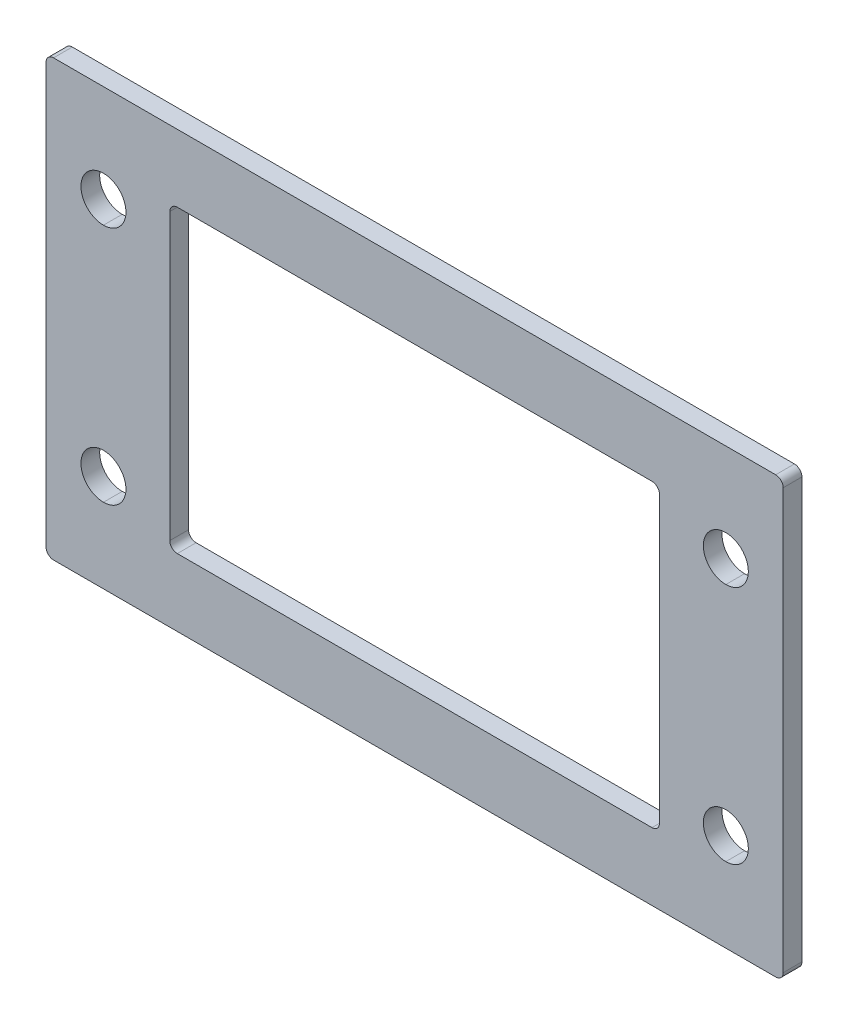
ISO-10303-21;
HEADER;
FILE_DESCRIPTION(('STEP AP214'),'2;1');
FILE_NAME('part.step','',(''),(''),'','','');
FILE_SCHEMA(('AUTOMOTIVE_DESIGN { 1 0 10303 214 1 1 1 1 }'));
ENDSEC;
DATA;
#1=APPLICATION_CONTEXT('core data for automotive mechanical design processes');
#2=APPLICATION_PROTOCOL_DEFINITION('international standard','automotive_design',2000,#1);
#3=PRODUCT_CONTEXT('',#1,'mechanical');
#4=PRODUCT('Part','Part','',(#3));
#5=PRODUCT_RELATED_PRODUCT_CATEGORY('part','',(#4));
#6=PRODUCT_DEFINITION_FORMATION('','',#4);
#7=PRODUCT_DEFINITION_CONTEXT('part definition',#1,'design');
#8=PRODUCT_DEFINITION('design','',#6,#7);
#9=PRODUCT_DEFINITION_SHAPE('','',#8);
#10=(LENGTH_UNIT() NAMED_UNIT(*) SI_UNIT(.MILLI.,.METRE.));
#11=(NAMED_UNIT(*) PLANE_ANGLE_UNIT() SI_UNIT($,.RADIAN.));
#12=(NAMED_UNIT(*) SI_UNIT($,.STERADIAN.) SOLID_ANGLE_UNIT());
#13=UNCERTAINTY_MEASURE_WITH_UNIT(LENGTH_MEASURE(1.E-05),#10,'distance_accuracy_value','');
#14=(GEOMETRIC_REPRESENTATION_CONTEXT(3) GLOBAL_UNCERTAINTY_ASSIGNED_CONTEXT((#13)) GLOBAL_UNIT_ASSIGNED_CONTEXT((#10,
#11,#12)) REPRESENTATION_CONTEXT('',''));
#15=CARTESIAN_POINT('',(0.,0.,0.));
#16=DIRECTION('',(0.,0.,1.));
#17=DIRECTION('',(1.,0.,0.));
#18=AXIS2_PLACEMENT_3D('',#15,#16,#17);
#19=CARTESIAN_POINT('',(-48.15,28.,-8.525));
#20=DIRECTION('',(0.,0.,-1.));
#21=DIRECTION('',(0.,1.,0.));
#22=AXIS2_PLACEMENT_3D('',#19,#20,#21);
#23=CYLINDRICAL_SURFACE('',#22,1.);
#24=CARTESIAN_POINT('',(-48.15,28.,-8.525));
#25=DIRECTION('',(0.,0.,1.));
#26=DIRECTION('',(0.,-1.,0.));
#27=AXIS2_PLACEMENT_3D('',#24,#25,#26);
#28=CIRCLE('',#27,1.);
#29=CARTESIAN_POINT('',(-48.15,29.,-8.525));
#30=VERTEX_POINT('',#29);
#31=CARTESIAN_POINT('',(-49.15,28.,-8.525));
#32=VERTEX_POINT('',#31);
#33=EDGE_CURVE('E374',#30,#32,#28,.T.);
#34=ORIENTED_EDGE('',*,*,#33,.F.);
#35=DIRECTION('',(0.,0.,1.));
#36=VECTOR('',#35,1.);
#37=CARTESIAN_POINT('',(-48.15,29.,-8.525));
#38=LINE('',#37,#36);
#39=CARTESIAN_POINT('',(-48.15,29.,-11.025));
#40=VERTEX_POINT('',#39);
#41=EDGE_CURVE('E402',#40,#30,#38,.T.);
#42=ORIENTED_EDGE('',*,*,#41,.F.);
#43=CARTESIAN_POINT('',(-48.15,28.,-11.025));
#44=DIRECTION('',(0.,0.,-1.));
#45=DIRECTION('',(0.,-1.,0.));
#46=AXIS2_PLACEMENT_3D('',#43,#44,#45);
#47=CIRCLE('',#46,1.);
#48=CARTESIAN_POINT('',(-49.15,28.,-11.025));
#49=VERTEX_POINT('',#48);
#50=EDGE_CURVE('E318',#49,#40,#47,.T.);
#51=ORIENTED_EDGE('',*,*,#50,.F.);
#52=DIRECTION('',(0.,0.,-1.));
#53=VECTOR('',#52,1.);
#54=CARTESIAN_POINT('',(-49.15,28.,-8.525));
#55=LINE('',#54,#53);
#56=EDGE_CURVE('E378',#32,#49,#55,.T.);
#57=ORIENTED_EDGE('',*,*,#56,.F.);
#58=EDGE_LOOP('',(#34,#42,#51,#57));
#59=FACE_BOUND('',#58,.T.);
#60=ADVANCED_FACE('F15',(#59),#23,.T.);
#61=CARTESIAN_POINT('',(-48.15,-28.,-8.525));
#62=DIRECTION('',(0.,0.,-1.));
#63=DIRECTION('',(0.,1.,0.));
#64=AXIS2_PLACEMENT_3D('',#61,#62,#63);
#65=CYLINDRICAL_SURFACE('',#64,1.);
#66=CARTESIAN_POINT('',(-48.15,-28.,-8.525));
#67=DIRECTION('',(0.,0.,1.));
#68=DIRECTION('',(0.,-1.,0.));
#69=AXIS2_PLACEMENT_3D('',#66,#67,#68);
#70=CIRCLE('',#69,1.);
#71=CARTESIAN_POINT('',(-49.15,-28.,-8.525));
#72=VERTEX_POINT('',#71);
#73=CARTESIAN_POINT('',(-48.15,-29.,-8.525));
#74=VERTEX_POINT('',#73);
#75=EDGE_CURVE('E386',#72,#74,#70,.T.);
#76=ORIENTED_EDGE('',*,*,#75,.F.);
#77=DIRECTION('',(0.,0.,1.));
#78=VECTOR('',#77,1.);
#79=CARTESIAN_POINT('',(-49.15,-28.,-8.525));
#80=LINE('',#79,#78);
#81=CARTESIAN_POINT('',(-49.15,-28.,-11.025));
#82=VERTEX_POINT('',#81);
#83=EDGE_CURVE('E375',#82,#72,#80,.T.);
#84=ORIENTED_EDGE('',*,*,#83,.F.);
#85=CARTESIAN_POINT('',(-48.15,-28.,-11.025));
#86=DIRECTION('',(0.,0.,-1.));
#87=DIRECTION('',(0.,-1.,0.));
#88=AXIS2_PLACEMENT_3D('',#85,#86,#87);
#89=CIRCLE('',#88,1.);
#90=CARTESIAN_POINT('',(-48.15,-29.,-11.025));
#91=VERTEX_POINT('',#90);
#92=EDGE_CURVE('E330',#91,#82,#89,.T.);
#93=ORIENTED_EDGE('',*,*,#92,.F.);
#94=DIRECTION('',(0.,0.,-1.));
#95=VECTOR('',#94,1.);
#96=CARTESIAN_POINT('',(-48.15,-29.,-8.525));
#97=LINE('',#96,#95);
#98=EDGE_CURVE('E269',#74,#91,#97,.T.);
#99=ORIENTED_EDGE('',*,*,#98,.F.);
#100=EDGE_LOOP('',(#76,#84,#93,#99));
#101=FACE_BOUND('',#100,.T.);
#102=ADVANCED_FACE('F541',(#101),#65,.T.);
#103=CARTESIAN_POINT('',(48.15,28.,-8.525));
#104=DIRECTION('',(0.,0.,-1.));
#105=DIRECTION('',(0.,1.,0.));
#106=AXIS2_PLACEMENT_3D('',#103,#104,#105);
#107=CYLINDRICAL_SURFACE('',#106,1.);
#108=CARTESIAN_POINT('',(48.15,28.,-8.525));
#109=DIRECTION('',(0.,0.,1.));
#110=DIRECTION('',(0.,-1.,0.));
#111=AXIS2_PLACEMENT_3D('',#108,#109,#110);
#112=CIRCLE('',#111,1.);
#113=CARTESIAN_POINT('',(49.15,28.,-8.525));
#114=VERTEX_POINT('',#113);
#115=CARTESIAN_POINT('',(48.15,29.,-8.525));
#116=VERTEX_POINT('',#115);
#117=EDGE_CURVE('E366',#114,#116,#112,.T.);
#118=ORIENTED_EDGE('',*,*,#117,.F.);
#119=DIRECTION('',(0.,0.,1.));
#120=VECTOR('',#119,1.);
#121=CARTESIAN_POINT('',(49.15,28.,-8.525));
#122=LINE('',#121,#120);
#123=CARTESIAN_POINT('',(49.15,28.,-11.025));
#124=VERTEX_POINT('',#123);
#125=EDGE_CURVE('E268',#124,#114,#122,.T.);
#126=ORIENTED_EDGE('',*,*,#125,.F.);
#127=CARTESIAN_POINT('',(48.15,28.,-11.025));
#128=DIRECTION('',(0.,0.,-1.));
#129=DIRECTION('',(0.,-1.,0.));
#130=AXIS2_PLACEMENT_3D('',#127,#128,#129);
#131=CIRCLE('',#130,1.);
#132=CARTESIAN_POINT('',(48.15,29.,-11.025));
#133=VERTEX_POINT('',#132);
#134=EDGE_CURVE('E239',#133,#124,#131,.T.);
#135=ORIENTED_EDGE('',*,*,#134,.F.);
#136=DIRECTION('',(0.,0.,-1.));
#137=VECTOR('',#136,1.);
#138=CARTESIAN_POINT('',(48.15,29.,-8.525));
#139=LINE('',#138,#137);
#140=EDGE_CURVE('E399',#116,#133,#139,.T.);
#141=ORIENTED_EDGE('',*,*,#140,.F.);
#142=EDGE_LOOP('',(#118,#126,#135,#141));
#143=FACE_BOUND('',#142,.T.);
#144=ADVANCED_FACE('F546',(#143),#107,.T.);
#145=CARTESIAN_POINT('',(48.15,-28.,-8.525));
#146=DIRECTION('',(0.,0.,-1.));
#147=DIRECTION('',(0.,1.,0.));
#148=AXIS2_PLACEMENT_3D('',#145,#146,#147);
#149=CYLINDRICAL_SURFACE('',#148,1.);
#150=CARTESIAN_POINT('',(48.15,-28.,-8.525));
#151=DIRECTION('',(0.,0.,1.));
#152=DIRECTION('',(0.,-1.,0.));
#153=AXIS2_PLACEMENT_3D('',#150,#151,#152);
#154=CIRCLE('',#153,1.);
#155=CARTESIAN_POINT('',(48.15,-29.,-8.525));
#156=VERTEX_POINT('',#155);
#157=CARTESIAN_POINT('',(49.15,-28.,-8.525));
#158=VERTEX_POINT('',#157);
#159=EDGE_CURVE('E355',#156,#158,#154,.T.);
#160=ORIENTED_EDGE('',*,*,#159,.F.);
#161=DIRECTION('',(0.,0.,1.));
#162=VECTOR('',#161,1.);
#163=CARTESIAN_POINT('',(48.15,-29.,-8.525));
#164=LINE('',#163,#162);
#165=CARTESIAN_POINT('',(48.15,-29.,-11.025));
#166=VERTEX_POINT('',#165);
#167=EDGE_CURVE('E416',#166,#156,#164,.T.);
#168=ORIENTED_EDGE('',*,*,#167,.F.);
#169=CARTESIAN_POINT('',(48.15,-28.,-11.025));
#170=DIRECTION('',(0.,0.,-1.));
#171=DIRECTION('',(0.,-1.,0.));
#172=AXIS2_PLACEMENT_3D('',#169,#170,#171);
#173=CIRCLE('',#172,1.);
#174=CARTESIAN_POINT('',(49.15,-28.,-11.025));
#175=VERTEX_POINT('',#174);
#176=EDGE_CURVE('E309',#175,#166,#173,.T.);
#177=ORIENTED_EDGE('',*,*,#176,.F.);
#178=DIRECTION('',(0.,0.,-1.));
#179=VECTOR('',#178,1.);
#180=CARTESIAN_POINT('',(49.15,-28.,-8.525));
#181=LINE('',#180,#179);
#182=EDGE_CURVE('E265',#158,#175,#181,.T.);
#183=ORIENTED_EDGE('',*,*,#182,.F.);
#184=EDGE_LOOP('',(#160,#168,#177,#183));
#185=FACE_BOUND('',#184,.T.);
#186=ADVANCED_FACE('F569',(#185),#149,.T.);
#187=CARTESIAN_POINT('',(-31.65,19.,-8.525));
#188=DIRECTION('',(0.,0.,1.));
#189=DIRECTION('',(0.,-1.,0.));
#190=AXIS2_PLACEMENT_3D('',#187,#188,#189);
#191=CYLINDRICAL_SURFACE('',#190,1.);
#192=CARTESIAN_POINT('',(-31.65,19.,-8.525));
#193=DIRECTION('',(0.,0.,-1.));
#194=DIRECTION('',(0.,-1.,0.));
#195=AXIS2_PLACEMENT_3D('',#192,#193,#194);
#196=CIRCLE('',#195,1.);
#197=CARTESIAN_POINT('',(-32.65,19.,-8.525));
#198=VERTEX_POINT('',#197);
#199=CARTESIAN_POINT('',(-31.65,20.,-8.525));
#200=VERTEX_POINT('',#199);
#201=EDGE_CURVE('E420',#198,#200,#196,.T.);
#202=ORIENTED_EDGE('',*,*,#201,.F.);
#203=DIRECTION('',(0.,0.,1.));
#204=VECTOR('',#203,1.);
#205=CARTESIAN_POINT('',(-32.65,19.,-8.525));
#206=LINE('',#205,#204);
#207=CARTESIAN_POINT('',(-32.65,19.,-11.025));
#208=VERTEX_POINT('',#207);
#209=EDGE_CURVE('E484',#208,#198,#206,.T.);
#210=ORIENTED_EDGE('',*,*,#209,.F.);
#211=CARTESIAN_POINT('',(-31.65,19.,-11.025));
#212=DIRECTION('',(0.,0.,1.));
#213=DIRECTION('',(0.,-1.,0.));
#214=AXIS2_PLACEMENT_3D('',#211,#212,#213);
#215=CIRCLE('',#214,1.);
#216=CARTESIAN_POINT('',(-31.65,20.,-11.025));
#217=VERTEX_POINT('',#216);
#218=EDGE_CURVE('E290',#217,#208,#215,.T.);
#219=ORIENTED_EDGE('',*,*,#218,.F.);
#220=DIRECTION('',(0.,0.,-1.));
#221=VECTOR('',#220,1.);
#222=CARTESIAN_POINT('',(-31.65,20.,-11.025));
#223=LINE('',#222,#221);
#224=EDGE_CURVE('E10',#200,#217,#223,.T.);
#225=ORIENTED_EDGE('',*,*,#224,.F.);
#226=EDGE_LOOP('',(#202,#210,#219,#225));
#227=FACE_BOUND('',#226,.T.);
#228=ADVANCED_FACE('F510',(#227),#191,.F.);
#229=CARTESIAN_POINT('',(-31.65,-19.,-8.525));
#230=DIRECTION('',(0.,0.,1.));
#231=DIRECTION('',(0.,-1.,0.));
#232=AXIS2_PLACEMENT_3D('',#229,#230,#231);
#233=CYLINDRICAL_SURFACE('',#232,1.);
#234=CARTESIAN_POINT('',(-31.65,-19.,-8.525));
#235=DIRECTION('',(0.,0.,-1.));
#236=DIRECTION('',(0.,-1.,0.));
#237=AXIS2_PLACEMENT_3D('',#234,#235,#236);
#238=CIRCLE('',#237,1.);
#239=CARTESIAN_POINT('',(-31.65,-20.,-8.525));
#240=VERTEX_POINT('',#239);
#241=CARTESIAN_POINT('',(-32.65,-19.,-8.525));
#242=VERTEX_POINT('',#241);
#243=EDGE_CURVE('E409',#240,#242,#238,.T.);
#244=ORIENTED_EDGE('',*,*,#243,.F.);
#245=DIRECTION('',(0.,0.,1.));
#246=VECTOR('',#245,1.);
#247=CARTESIAN_POINT('',(-31.65,-20.,-8.525));
#248=LINE('',#247,#246);
#249=CARTESIAN_POINT('',(-31.65,-20.,-11.025));
#250=VERTEX_POINT('',#249);
#251=EDGE_CURVE('E358',#250,#240,#248,.T.);
#252=ORIENTED_EDGE('',*,*,#251,.F.);
#253=CARTESIAN_POINT('',(-31.65,-19.,-11.025));
#254=DIRECTION('',(0.,0.,1.));
#255=DIRECTION('',(0.,-1.,0.));
#256=AXIS2_PLACEMENT_3D('',#253,#254,#255);
#257=CIRCLE('',#256,1.);
#258=CARTESIAN_POINT('',(-32.65,-19.,-11.025));
#259=VERTEX_POINT('',#258);
#260=EDGE_CURVE('E461',#259,#250,#257,.T.);
#261=ORIENTED_EDGE('',*,*,#260,.F.);
#262=DIRECTION('',(0.,0.,-1.));
#263=VECTOR('',#262,1.);
#264=CARTESIAN_POINT('',(-32.65,-19.,-11.025));
#265=LINE('',#264,#263);
#266=EDGE_CURVE('E481',#242,#259,#265,.T.);
#267=ORIENTED_EDGE('',*,*,#266,.F.);
#268=EDGE_LOOP('',(#244,#252,#261,#267));
#269=FACE_BOUND('',#268,.T.);
#270=ADVANCED_FACE('F523',(#269),#233,.F.);
#271=CARTESIAN_POINT('',(31.65,-19.,-8.525));
#272=DIRECTION('',(0.,0.,1.));
#273=DIRECTION('',(0.,-1.,0.));
#274=AXIS2_PLACEMENT_3D('',#271,#272,#273);
#275=CYLINDRICAL_SURFACE('',#274,1.);
#276=CARTESIAN_POINT('',(31.65,-19.,-8.525));
#277=DIRECTION('',(0.,0.,-1.));
#278=DIRECTION('',(0.,-1.,0.));
#279=AXIS2_PLACEMENT_3D('',#276,#277,#278);
#280=CIRCLE('',#279,1.);
#281=CARTESIAN_POINT('',(32.65,-19.,-8.525));
#282=VERTEX_POINT('',#281);
#283=CARTESIAN_POINT('',(31.65,-20.,-8.525));
#284=VERTEX_POINT('',#283);
#285=EDGE_CURVE('E280',#282,#284,#280,.T.);
#286=ORIENTED_EDGE('',*,*,#285,.F.);
#287=DIRECTION('',(0.,0.,1.));
#288=VECTOR('',#287,1.);
#289=CARTESIAN_POINT('',(32.65,-19.,-8.525));
#290=LINE('',#289,#288);
#291=CARTESIAN_POINT('',(32.65,-19.,-11.025));
#292=VERTEX_POINT('',#291);
#293=EDGE_CURVE('E44',#292,#282,#290,.T.);
#294=ORIENTED_EDGE('',*,*,#293,.F.);
#295=CARTESIAN_POINT('',(31.65,-19.,-11.025));
#296=DIRECTION('',(0.,0.,1.));
#297=DIRECTION('',(0.,-1.,0.));
#298=AXIS2_PLACEMENT_3D('',#295,#296,#297);
#299=CIRCLE('',#298,1.);
#300=CARTESIAN_POINT('',(31.65,-20.,-11.025));
#301=VERTEX_POINT('',#300);
#302=EDGE_CURVE('E342',#301,#292,#299,.T.);
#303=ORIENTED_EDGE('',*,*,#302,.F.);
#304=DIRECTION('',(0.,0.,-1.));
#305=VECTOR('',#304,1.);
#306=CARTESIAN_POINT('',(31.65,-20.,-11.025));
#307=LINE('',#306,#305);
#308=EDGE_CURVE('E487',#284,#301,#307,.T.);
#309=ORIENTED_EDGE('',*,*,#308,.F.);
#310=EDGE_LOOP('',(#286,#294,#303,#309));
#311=FACE_BOUND('',#310,.T.);
#312=ADVANCED_FACE('F516',(#311),#275,.F.);
#313=CARTESIAN_POINT('',(31.65,19.,-8.525));
#314=DIRECTION('',(0.,0.,1.));
#315=DIRECTION('',(0.,-1.,0.));
#316=AXIS2_PLACEMENT_3D('',#313,#314,#315);
#317=CYLINDRICAL_SURFACE('',#316,1.);
#318=CARTESIAN_POINT('',(31.65,19.,-8.525));
#319=DIRECTION('',(0.,0.,-1.));
#320=DIRECTION('',(0.,-1.,0.));
#321=AXIS2_PLACEMENT_3D('',#318,#319,#320);
#322=CIRCLE('',#321,1.);
#323=CARTESIAN_POINT('',(31.65,20.,-8.525));
#324=VERTEX_POINT('',#323);
#325=CARTESIAN_POINT('',(32.65,19.,-8.525));
#326=VERTEX_POINT('',#325);
#327=EDGE_CURVE('E281',#324,#326,#322,.T.);
#328=ORIENTED_EDGE('',*,*,#327,.F.);
#329=DIRECTION('',(0.,0.,1.));
#330=VECTOR('',#329,1.);
#331=CARTESIAN_POINT('',(31.65,20.,-8.525));
#332=LINE('',#331,#330);
#333=CARTESIAN_POINT('',(31.65,20.,-11.025));
#334=VERTEX_POINT('',#333);
#335=EDGE_CURVE('E23',#334,#324,#332,.T.);
#336=ORIENTED_EDGE('',*,*,#335,.F.);
#337=CARTESIAN_POINT('',(31.65,19.,-11.025));
#338=DIRECTION('',(0.,0.,1.));
#339=DIRECTION('',(0.,-1.,0.));
#340=AXIS2_PLACEMENT_3D('',#337,#338,#339);
#341=CIRCLE('',#340,1.);
#342=CARTESIAN_POINT('',(32.65,19.,-11.025));
#343=VERTEX_POINT('',#342);
#344=EDGE_CURVE('E341',#343,#334,#341,.T.);
#345=ORIENTED_EDGE('',*,*,#344,.F.);
#346=DIRECTION('',(0.,0.,-1.));
#347=VECTOR('',#346,1.);
#348=CARTESIAN_POINT('',(32.65,19.,-11.025));
#349=LINE('',#348,#347);
#350=EDGE_CURVE('E34',#326,#343,#349,.T.);
#351=ORIENTED_EDGE('',*,*,#350,.F.);
#352=EDGE_LOOP('',(#328,#336,#345,#351));
#353=FACE_BOUND('',#352,.T.);
#354=ADVANCED_FACE('F501',(#353),#317,.F.);
#355=CARTESIAN_POINT('',(-41.5,16.,-8.525));
#356=DIRECTION('',(0.,0.,1.));
#357=DIRECTION('',(0.,-1.,0.));
#358=AXIS2_PLACEMENT_3D('',#355,#356,#357);
#359=CYLINDRICAL_SURFACE('',#358,3.);
#360=DIRECTION('',(0.,0.,1.));
#361=VECTOR('',#360,1.);
#362=CARTESIAN_POINT('',(-41.5,19.,-8.525));
#363=LINE('',#362,#361);
#364=CARTESIAN_POINT('',(-41.5,19.,-11.025));
#365=VERTEX_POINT('',#364);
#366=CARTESIAN_POINT('',(-41.5,19.,-8.525));
#367=VERTEX_POINT('',#366);
#368=EDGE_CURVE('E242',#365,#367,#363,.T.);
#369=ORIENTED_EDGE('',*,*,#368,.F.);
#370=CARTESIAN_POINT('',(-41.5,16.,-11.025));
#371=DIRECTION('',(0.,0.,1.));
#372=DIRECTION('',(0.,-1.,0.));
#373=AXIS2_PLACEMENT_3D('',#370,#371,#372);
#374=CIRCLE('',#373,3.);
#375=CARTESIAN_POINT('',(-41.5,13.,-11.025));
#376=VERTEX_POINT('',#375);
#377=EDGE_CURVE('E228',#376,#365,#374,.T.);
#378=ORIENTED_EDGE('',*,*,#377,.F.);
#379=DIRECTION('',(0.,0.,1.));
#380=VECTOR('',#379,1.);
#381=CARTESIAN_POINT('',(-41.5,13.,-8.525));
#382=LINE('',#381,#380);
#383=CARTESIAN_POINT('',(-41.5,13.,-8.525));
#384=VERTEX_POINT('',#383);
#385=EDGE_CURVE('E252',#376,#384,#382,.T.);
#386=ORIENTED_EDGE('',*,*,#385,.T.);
#387=CARTESIAN_POINT('',(-41.5,16.,-8.525));
#388=DIRECTION('',(0.,0.,1.));
#389=DIRECTION('',(0.,-1.,0.));
#390=AXIS2_PLACEMENT_3D('',#387,#388,#389);
#391=CIRCLE('',#390,3.);
#392=EDGE_CURVE('E244',#384,#367,#391,.T.);
#393=ORIENTED_EDGE('',*,*,#392,.T.);
#394=EDGE_LOOP('',(#369,#378,#386,#393));
#395=FACE_BOUND('',#394,.T.);
#396=ADVANCED_FACE('F243',(#395),#359,.F.);
#397=CARTESIAN_POINT('',(-41.5,-16.,-8.525));
#398=DIRECTION('',(0.,0.,1.));
#399=DIRECTION('',(0.,-1.,0.));
#400=AXIS2_PLACEMENT_3D('',#397,#398,#399);
#401=CYLINDRICAL_SURFACE('',#400,3.);
#402=DIRECTION('',(0.,0.,1.));
#403=VECTOR('',#402,1.);
#404=CARTESIAN_POINT('',(-41.5,-13.,-8.525));
#405=LINE('',#404,#403);
#406=CARTESIAN_POINT('',(-41.5,-13.,-11.025));
#407=VERTEX_POINT('',#406);
#408=CARTESIAN_POINT('',(-41.5,-13.,-8.525));
#409=VERTEX_POINT('',#408);
#410=EDGE_CURVE('E285',#407,#409,#405,.T.);
#411=ORIENTED_EDGE('',*,*,#410,.F.);
#412=CARTESIAN_POINT('',(-41.5,-16.,-11.025));
#413=DIRECTION('',(0.,0.,1.));
#414=DIRECTION('',(0.,-1.,0.));
#415=AXIS2_PLACEMENT_3D('',#412,#413,#414);
#416=CIRCLE('',#415,3.);
#417=CARTESIAN_POINT('',(-41.5,-19.,-11.025));
#418=VERTEX_POINT('',#417);
#419=EDGE_CURVE('E238',#418,#407,#416,.T.);
#420=ORIENTED_EDGE('',*,*,#419,.F.);
#421=DIRECTION('',(0.,0.,1.));
#422=VECTOR('',#421,1.);
#423=CARTESIAN_POINT('',(-41.5,-19.,-8.525));
#424=LINE('',#423,#422);
#425=CARTESIAN_POINT('',(-41.5,-19.,-8.525));
#426=VERTEX_POINT('',#425);
#427=EDGE_CURVE('E313',#418,#426,#424,.T.);
#428=ORIENTED_EDGE('',*,*,#427,.T.);
#429=CARTESIAN_POINT('',(-41.5,-16.,-8.525));
#430=DIRECTION('',(0.,0.,1.));
#431=DIRECTION('',(0.,-1.,0.));
#432=AXIS2_PLACEMENT_3D('',#429,#430,#431);
#433=CIRCLE('',#432,3.);
#434=EDGE_CURVE('E392',#426,#409,#433,.T.);
#435=ORIENTED_EDGE('',*,*,#434,.T.);
#436=EDGE_LOOP('',(#411,#420,#428,#435));
#437=FACE_BOUND('',#436,.T.);
#438=ADVANCED_FACE('F590',(#437),#401,.F.);
#439=CARTESIAN_POINT('',(41.5,-16.,-8.525));
#440=DIRECTION('',(0.,0.,1.));
#441=DIRECTION('',(0.,-1.,0.));
#442=AXIS2_PLACEMENT_3D('',#439,#440,#441);
#443=CYLINDRICAL_SURFACE('',#442,3.);
#444=DIRECTION('',(0.,0.,1.));
#445=VECTOR('',#444,1.);
#446=CARTESIAN_POINT('',(41.5,-13.,-8.525));
#447=LINE('',#446,#445);
#448=CARTESIAN_POINT('',(41.5,-13.,-11.025));
#449=VERTEX_POINT('',#448);
#450=CARTESIAN_POINT('',(41.5,-13.,-8.525));
#451=VERTEX_POINT('',#450);
#452=EDGE_CURVE('E257',#449,#451,#447,.T.);
#453=ORIENTED_EDGE('',*,*,#452,.F.);
#454=CARTESIAN_POINT('',(41.5,-16.,-11.025));
#455=DIRECTION('',(0.,0.,1.));
#456=DIRECTION('',(0.,-1.,0.));
#457=AXIS2_PLACEMENT_3D('',#454,#455,#456);
#458=CIRCLE('',#457,3.);
#459=CARTESIAN_POINT('',(41.5,-19.,-11.025));
#460=VERTEX_POINT('',#459);
#461=EDGE_CURVE('E298',#460,#449,#458,.T.);
#462=ORIENTED_EDGE('',*,*,#461,.F.);
#463=DIRECTION('',(0.,0.,1.));
#464=VECTOR('',#463,1.);
#465=CARTESIAN_POINT('',(41.5,-19.,-8.525));
#466=LINE('',#465,#464);
#467=CARTESIAN_POINT('',(41.5,-19.,-8.525));
#468=VERTEX_POINT('',#467);
#469=EDGE_CURVE('E273',#460,#468,#466,.T.);
#470=ORIENTED_EDGE('',*,*,#469,.T.);
#471=CARTESIAN_POINT('',(41.5,-16.,-8.525));
#472=DIRECTION('',(0.,0.,1.));
#473=DIRECTION('',(0.,-1.,0.));
#474=AXIS2_PLACEMENT_3D('',#471,#472,#473);
#475=CIRCLE('',#474,3.);
#476=EDGE_CURVE('E395',#468,#451,#475,.T.);
#477=ORIENTED_EDGE('',*,*,#476,.T.);
#478=EDGE_LOOP('',(#453,#462,#470,#477));
#479=FACE_BOUND('',#478,.T.);
#480=ADVANCED_FACE('F593',(#479),#443,.F.);
#481=CARTESIAN_POINT('',(41.5,16.,-8.525));
#482=DIRECTION('',(0.,0.,1.));
#483=DIRECTION('',(0.,-1.,0.));
#484=AXIS2_PLACEMENT_3D('',#481,#482,#483);
#485=CYLINDRICAL_SURFACE('',#484,3.);
#486=DIRECTION('',(0.,0.,1.));
#487=VECTOR('',#486,1.);
#488=CARTESIAN_POINT('',(41.5,19.,-8.525));
#489=LINE('',#488,#487);
#490=CARTESIAN_POINT('',(41.5,19.,-11.025));
#491=VERTEX_POINT('',#490);
#492=CARTESIAN_POINT('',(41.5,19.,-8.525));
#493=VERTEX_POINT('',#492);
#494=EDGE_CURVE('E299',#491,#493,#489,.T.);
#495=ORIENTED_EDGE('',*,*,#494,.F.);
#496=CARTESIAN_POINT('',(41.5,16.,-11.025));
#497=DIRECTION('',(0.,0.,1.));
#498=DIRECTION('',(0.,-1.,0.));
#499=AXIS2_PLACEMENT_3D('',#496,#497,#498);
#500=CIRCLE('',#499,3.);
#501=CARTESIAN_POINT('',(41.5,13.,-11.025));
#502=VERTEX_POINT('',#501);
#503=EDGE_CURVE('E291',#502,#491,#500,.T.);
#504=ORIENTED_EDGE('',*,*,#503,.F.);
#505=DIRECTION('',(0.,0.,1.));
#506=VECTOR('',#505,1.);
#507=CARTESIAN_POINT('',(41.5,13.,-8.525));
#508=LINE('',#507,#506);
#509=CARTESIAN_POINT('',(41.5,13.,-8.525));
#510=VERTEX_POINT('',#509);
#511=EDGE_CURVE('E322',#502,#510,#508,.T.);
#512=ORIENTED_EDGE('',*,*,#511,.T.);
#513=CARTESIAN_POINT('',(41.5,16.,-8.525));
#514=DIRECTION('',(0.,0.,1.));
#515=DIRECTION('',(0.,-1.,0.));
#516=AXIS2_PLACEMENT_3D('',#513,#514,#515);
#517=CIRCLE('',#516,3.);
#518=EDGE_CURVE('E398',#510,#493,#517,.T.);
#519=ORIENTED_EDGE('',*,*,#518,.T.);
#520=EDGE_LOOP('',(#495,#504,#512,#519));
#521=FACE_BOUND('',#520,.T.);
#522=ADVANCED_FACE('F597',(#521),#485,.F.);
#523=CARTESIAN_POINT('',(-32.65,20.,-8.525));
#524=DIRECTION('',(0.,-1.,0.));
#525=DIRECTION('',(1.,0.,0.));
#526=AXIS2_PLACEMENT_3D('',#523,#524,#525);
#527=PLANE('',#526);
#528=DIRECTION('',(-1.,0.,0.));
#529=VECTOR('',#528,1.);
#530=CARTESIAN_POINT('',(-32.65,20.,-11.025));
#531=LINE('',#530,#529);
#532=EDGE_CURVE('E286',#334,#217,#531,.T.);
#533=ORIENTED_EDGE('',*,*,#532,.F.);
#534=ORIENTED_EDGE('',*,*,#335,.T.);
#535=DIRECTION('',(-1.,0.,0.));
#536=VECTOR('',#535,1.);
#537=CARTESIAN_POINT('',(-32.65,20.,-8.525));
#538=LINE('',#537,#536);
#539=EDGE_CURVE('E424',#324,#200,#538,.T.);
#540=ORIENTED_EDGE('',*,*,#539,.T.);
#541=ORIENTED_EDGE('',*,*,#224,.T.);
#542=EDGE_LOOP('',(#533,#534,#540,#541));
#543=FACE_BOUND('',#542,.T.);
#544=ADVANCED_FACE('F498',(#543),#527,.T.);
#545=CARTESIAN_POINT('',(32.65,20.,-8.525));
#546=DIRECTION('',(-1.,0.,0.));
#547=DIRECTION('',(0.,0.,1.));
#548=AXIS2_PLACEMENT_3D('',#545,#546,#547);
#549=PLANE('',#548);
#550=DIRECTION('',(0.,1.,0.));
#551=VECTOR('',#550,1.);
#552=CARTESIAN_POINT('',(32.65,20.,-8.525));
#553=LINE('',#552,#551);
#554=EDGE_CURVE('E277',#282,#326,#553,.T.);
#555=ORIENTED_EDGE('',*,*,#554,.T.);
#556=ORIENTED_EDGE('',*,*,#350,.T.);
#557=DIRECTION('',(0.,1.,0.));
#558=VECTOR('',#557,1.);
#559=CARTESIAN_POINT('',(32.65,20.,-11.025));
#560=LINE('',#559,#558);
#561=EDGE_CURVE('E337',#292,#343,#560,.T.);
#562=ORIENTED_EDGE('',*,*,#561,.F.);
#563=ORIENTED_EDGE('',*,*,#293,.T.);
#564=EDGE_LOOP('',(#555,#556,#562,#563));
#565=FACE_BOUND('',#564,.T.);
#566=ADVANCED_FACE('F515',(#565),#549,.T.);
#567=CARTESIAN_POINT('',(-32.65,-20.,-8.525));
#568=DIRECTION('',(0.,1.,0.));
#569=DIRECTION('',(0.,0.,-1.));
#570=AXIS2_PLACEMENT_3D('',#567,#568,#569);
#571=PLANE('',#570);
#572=DIRECTION('',(1.,0.,0.));
#573=VECTOR('',#572,1.);
#574=CARTESIAN_POINT('',(-32.65,-20.,-8.525));
#575=LINE('',#574,#573);
#576=EDGE_CURVE('E405',#240,#284,#575,.T.);
#577=ORIENTED_EDGE('',*,*,#576,.T.);
#578=ORIENTED_EDGE('',*,*,#308,.T.);
#579=DIRECTION('',(1.,0.,0.));
#580=VECTOR('',#579,1.);
#581=CARTESIAN_POINT('',(-32.65,-20.,-11.025));
#582=LINE('',#581,#580);
#583=EDGE_CURVE('E465',#250,#301,#582,.T.);
#584=ORIENTED_EDGE('',*,*,#583,.F.);
#585=ORIENTED_EDGE('',*,*,#251,.T.);
#586=EDGE_LOOP('',(#577,#578,#584,#585));
#587=FACE_BOUND('',#586,.T.);
#588=ADVANCED_FACE('F518',(#587),#571,.T.);
#589=CARTESIAN_POINT('',(-32.65,20.,-8.525));
#590=DIRECTION('',(1.,0.,0.));
#591=DIRECTION('',(0.,1.,0.));
#592=AXIS2_PLACEMENT_3D('',#589,#590,#591);
#593=PLANE('',#592);
#594=DIRECTION('',(0.,-1.,0.));
#595=VECTOR('',#594,1.);
#596=CARTESIAN_POINT('',(-32.65,20.,-8.525));
#597=LINE('',#596,#595);
#598=EDGE_CURVE('E413',#198,#242,#597,.T.);
#599=ORIENTED_EDGE('',*,*,#598,.T.);
#600=ORIENTED_EDGE('',*,*,#266,.T.);
#601=DIRECTION('',(0.,-1.,0.));
#602=VECTOR('',#601,1.);
#603=CARTESIAN_POINT('',(-32.65,20.,-11.025));
#604=LINE('',#603,#602);
#605=EDGE_CURVE('E457',#208,#259,#604,.T.);
#606=ORIENTED_EDGE('',*,*,#605,.F.);
#607=ORIENTED_EDGE('',*,*,#209,.T.);
#608=EDGE_LOOP('',(#599,#600,#606,#607));
#609=FACE_BOUND('',#608,.T.);
#610=ADVANCED_FACE('F525',(#609),#593,.T.);
#611=CARTESIAN_POINT('',(-49.15,29.,-8.525));
#612=DIRECTION('',(0.,-1.,0.));
#613=DIRECTION('',(1.,0.,0.));
#614=AXIS2_PLACEMENT_3D('',#611,#612,#613);
#615=PLANE('',#614);
#616=DIRECTION('',(-1.,0.,0.));
#617=VECTOR('',#616,1.);
#618=CARTESIAN_POINT('',(-49.15,29.,-8.525));
#619=LINE('',#618,#617);
#620=EDGE_CURVE('E370',#116,#30,#619,.T.);
#621=ORIENTED_EDGE('',*,*,#620,.F.);
#622=ORIENTED_EDGE('',*,*,#140,.T.);
#623=DIRECTION('',(-1.,0.,0.));
#624=VECTOR('',#623,1.);
#625=CARTESIAN_POINT('',(-49.15,29.,-11.025));
#626=LINE('',#625,#624);
#627=EDGE_CURVE('E314',#133,#40,#626,.T.);
#628=ORIENTED_EDGE('',*,*,#627,.T.);
#629=ORIENTED_EDGE('',*,*,#41,.T.);
#630=EDGE_LOOP('',(#621,#622,#628,#629));
#631=FACE_BOUND('',#630,.T.);
#632=ADVANCED_FACE('F527',(#631),#615,.F.);
#633=CARTESIAN_POINT('',(49.15,29.,-8.525));
#634=DIRECTION('',(-1.,0.,0.));
#635=DIRECTION('',(0.,-1.,0.));
#636=AXIS2_PLACEMENT_3D('',#633,#634,#635);
#637=PLANE('',#636);
#638=DIRECTION('',(0.,1.,0.));
#639=VECTOR('',#638,1.);
#640=CARTESIAN_POINT('',(49.15,29.,-8.525));
#641=LINE('',#640,#639);
#642=EDGE_CURVE('E362',#158,#114,#641,.T.);
#643=ORIENTED_EDGE('',*,*,#642,.F.);
#644=ORIENTED_EDGE('',*,*,#182,.T.);
#645=DIRECTION('',(0.,1.,0.));
#646=VECTOR('',#645,1.);
#647=CARTESIAN_POINT('',(49.15,29.,-11.025));
#648=LINE('',#647,#646);
#649=EDGE_CURVE('E305',#175,#124,#648,.T.);
#650=ORIENTED_EDGE('',*,*,#649,.T.);
#651=ORIENTED_EDGE('',*,*,#125,.T.);
#652=EDGE_LOOP('',(#643,#644,#650,#651));
#653=FACE_BOUND('',#652,.T.);
#654=ADVANCED_FACE('F534',(#653),#637,.F.);
#655=CARTESIAN_POINT('',(-49.15,-29.,-8.525));
#656=DIRECTION('',(0.,1.,0.));
#657=DIRECTION('',(0.,0.,-1.));
#658=AXIS2_PLACEMENT_3D('',#655,#656,#657);
#659=PLANE('',#658);
#660=DIRECTION('',(1.,0.,0.));
#661=VECTOR('',#660,1.);
#662=CARTESIAN_POINT('',(-49.15,-29.,-11.025));
#663=LINE('',#662,#661);
#664=EDGE_CURVE('E326',#91,#166,#663,.T.);
#665=ORIENTED_EDGE('',*,*,#664,.T.);
#666=ORIENTED_EDGE('',*,*,#167,.T.);
#667=DIRECTION('',(1.,0.,0.));
#668=VECTOR('',#667,1.);
#669=CARTESIAN_POINT('',(-49.15,-29.,-8.525));
#670=LINE('',#669,#668);
#671=EDGE_CURVE('E351',#74,#156,#670,.T.);
#672=ORIENTED_EDGE('',*,*,#671,.F.);
#673=ORIENTED_EDGE('',*,*,#98,.T.);
#674=EDGE_LOOP('',(#665,#666,#672,#673));
#675=FACE_BOUND('',#674,.T.);
#676=ADVANCED_FACE('F565',(#675),#659,.F.);
#677=CARTESIAN_POINT('',(-49.15,29.,-8.525));
#678=DIRECTION('',(1.,0.,0.));
#679=DIRECTION('',(0.,0.,1.));
#680=AXIS2_PLACEMENT_3D('',#677,#678,#679);
#681=PLANE('',#680);
#682=DIRECTION('',(0.,-1.,0.));
#683=VECTOR('',#682,1.);
#684=CARTESIAN_POINT('',(-49.15,29.,-11.025));
#685=LINE('',#684,#683);
#686=EDGE_CURVE('E442',#49,#82,#685,.T.);
#687=ORIENTED_EDGE('',*,*,#686,.T.);
#688=ORIENTED_EDGE('',*,*,#83,.T.);
#689=DIRECTION('',(0.,-1.,0.));
#690=VECTOR('',#689,1.);
#691=CARTESIAN_POINT('',(-49.15,29.,-8.525));
#692=LINE('',#691,#690);
#693=EDGE_CURVE('E382',#32,#72,#692,.T.);
#694=ORIENTED_EDGE('',*,*,#693,.F.);
#695=ORIENTED_EDGE('',*,*,#56,.T.);
#696=EDGE_LOOP('',(#687,#688,#694,#695));
#697=FACE_BOUND('',#696,.T.);
#698=ADVANCED_FACE('F561',(#697),#681,.F.);
#699=CARTESIAN_POINT('',(-49.15,-29.,-11.025));
#700=DIRECTION('',(0.,0.,1.));
#701=DIRECTION('',(1.,0.,0.));
#702=AXIS2_PLACEMENT_3D('',#699,#700,#701);
#703=PLANE('',#702);
#704=ORIENTED_EDGE('',*,*,#532,.T.);
#705=ORIENTED_EDGE('',*,*,#218,.T.);
#706=ORIENTED_EDGE('',*,*,#605,.T.);
#707=ORIENTED_EDGE('',*,*,#260,.T.);
#708=ORIENTED_EDGE('',*,*,#583,.T.);
#709=ORIENTED_EDGE('',*,*,#302,.T.);
#710=ORIENTED_EDGE('',*,*,#561,.T.);
#711=ORIENTED_EDGE('',*,*,#344,.T.);
#712=EDGE_LOOP('',(#704,#705,#706,#707,#708,#709,#710,#711));
#713=FACE_BOUND('',#712,.T.);
#714=ORIENTED_EDGE('',*,*,#503,.T.);
#715=CARTESIAN_POINT('',(41.5,16.,-11.025));
#716=DIRECTION('',(0.,0.,1.));
#717=DIRECTION('',(0.,-1.,0.));
#718=AXIS2_PLACEMENT_3D('',#715,#716,#717);
#719=CIRCLE('',#718,3.);
#720=EDGE_CURVE('E304',#491,#502,#719,.T.);
#721=ORIENTED_EDGE('',*,*,#720,.T.);
#722=EDGE_LOOP('',(#714,#721));
#723=FACE_BOUND('',#722,.T.);
#724=ORIENTED_EDGE('',*,*,#461,.T.);
#725=CARTESIAN_POINT('',(41.5,-16.,-11.025));
#726=DIRECTION('',(0.,0.,1.));
#727=DIRECTION('',(0.,-1.,0.));
#728=AXIS2_PLACEMENT_3D('',#725,#726,#727);
#729=CIRCLE('',#728,3.);
#730=EDGE_CURVE('E262',#449,#460,#729,.T.);
#731=ORIENTED_EDGE('',*,*,#730,.T.);
#732=EDGE_LOOP('',(#724,#731));
#733=FACE_BOUND('',#732,.T.);
#734=ORIENTED_EDGE('',*,*,#419,.T.);
#735=CARTESIAN_POINT('',(-41.5,-16.,-11.025));
#736=DIRECTION('',(0.,0.,1.));
#737=DIRECTION('',(0.,-1.,0.));
#738=AXIS2_PLACEMENT_3D('',#735,#736,#737);
#739=CIRCLE('',#738,3.);
#740=EDGE_CURVE('E276',#407,#418,#739,.T.);
#741=ORIENTED_EDGE('',*,*,#740,.T.);
#742=EDGE_LOOP('',(#734,#741));
#743=FACE_BOUND('',#742,.T.);
#744=ORIENTED_EDGE('',*,*,#377,.T.);
#745=CARTESIAN_POINT('',(-41.5,16.,-11.025));
#746=DIRECTION('',(0.,0.,1.));
#747=DIRECTION('',(0.,-1.,0.));
#748=AXIS2_PLACEMENT_3D('',#745,#746,#747);
#749=CIRCLE('',#748,3.);
#750=EDGE_CURVE('E233',#365,#376,#749,.T.);
#751=ORIENTED_EDGE('',*,*,#750,.T.);
#752=EDGE_LOOP('',(#744,#751));
#753=FACE_BOUND('',#752,.T.);
#754=ORIENTED_EDGE('',*,*,#649,.F.);
#755=ORIENTED_EDGE('',*,*,#176,.T.);
#756=ORIENTED_EDGE('',*,*,#664,.F.);
#757=ORIENTED_EDGE('',*,*,#92,.T.);
#758=ORIENTED_EDGE('',*,*,#686,.F.);
#759=ORIENTED_EDGE('',*,*,#50,.T.);
#760=ORIENTED_EDGE('',*,*,#627,.F.);
#761=ORIENTED_EDGE('',*,*,#134,.T.);
#762=EDGE_LOOP('',(#754,#755,#756,#757,#758,#759,#760,#761));
#763=FACE_BOUND('',#762,.T.);
#764=ADVANCED_FACE('F230',(#713,#723,#733,#743,#753,#763),#703,.F.);
#765=CARTESIAN_POINT('',(-49.15,-29.,-8.525));
#766=DIRECTION('',(0.,0.,1.));
#767=DIRECTION('',(1.,0.,0.));
#768=AXIS2_PLACEMENT_3D('',#765,#766,#767);
#769=PLANE('',#768);
#770=ORIENTED_EDGE('',*,*,#576,.F.);
#771=ORIENTED_EDGE('',*,*,#243,.T.);
#772=ORIENTED_EDGE('',*,*,#598,.F.);
#773=ORIENTED_EDGE('',*,*,#201,.T.);
#774=ORIENTED_EDGE('',*,*,#539,.F.);
#775=ORIENTED_EDGE('',*,*,#327,.T.);
#776=ORIENTED_EDGE('',*,*,#554,.F.);
#777=ORIENTED_EDGE('',*,*,#285,.T.);
#778=EDGE_LOOP('',(#770,#771,#772,#773,#774,#775,#776,#777));
#779=FACE_BOUND('',#778,.T.);
#780=ORIENTED_EDGE('',*,*,#518,.F.);
#781=CARTESIAN_POINT('',(41.5,16.,-8.525));
#782=DIRECTION('',(0.,0.,1.));
#783=DIRECTION('',(0.,-1.,0.));
#784=AXIS2_PLACEMENT_3D('',#781,#782,#783);
#785=CIRCLE('',#784,3.);
#786=EDGE_CURVE('E303',#493,#510,#785,.T.);
#787=ORIENTED_EDGE('',*,*,#786,.F.);
#788=EDGE_LOOP('',(#780,#787));
#789=FACE_BOUND('',#788,.T.);
#790=ORIENTED_EDGE('',*,*,#476,.F.);
#791=CARTESIAN_POINT('',(41.5,-16.,-8.525));
#792=DIRECTION('',(0.,0.,1.));
#793=DIRECTION('',(0.,-1.,0.));
#794=AXIS2_PLACEMENT_3D('',#791,#792,#793);
#795=CIRCLE('',#794,3.);
#796=EDGE_CURVE('E261',#451,#468,#795,.T.);
#797=ORIENTED_EDGE('',*,*,#796,.F.);
#798=EDGE_LOOP('',(#790,#797));
#799=FACE_BOUND('',#798,.T.);
#800=ORIENTED_EDGE('',*,*,#434,.F.);
#801=CARTESIAN_POINT('',(-41.5,-16.,-8.525));
#802=DIRECTION('',(0.,0.,1.));
#803=DIRECTION('',(0.,-1.,0.));
#804=AXIS2_PLACEMENT_3D('',#801,#802,#803);
#805=CIRCLE('',#804,3.);
#806=EDGE_CURVE('E295',#409,#426,#805,.T.);
#807=ORIENTED_EDGE('',*,*,#806,.F.);
#808=EDGE_LOOP('',(#800,#807));
#809=FACE_BOUND('',#808,.T.);
#810=ORIENTED_EDGE('',*,*,#392,.F.);
#811=CARTESIAN_POINT('',(-41.5,16.,-8.525));
#812=DIRECTION('',(0.,0.,1.));
#813=DIRECTION('',(0.,-1.,0.));
#814=AXIS2_PLACEMENT_3D('',#811,#812,#813);
#815=CIRCLE('',#814,3.);
#816=EDGE_CURVE('E249',#367,#384,#815,.T.);
#817=ORIENTED_EDGE('',*,*,#816,.F.);
#818=EDGE_LOOP('',(#810,#817));
#819=FACE_BOUND('',#818,.T.);
#820=ORIENTED_EDGE('',*,*,#671,.T.);
#821=ORIENTED_EDGE('',*,*,#159,.T.);
#822=ORIENTED_EDGE('',*,*,#642,.T.);
#823=ORIENTED_EDGE('',*,*,#117,.T.);
#824=ORIENTED_EDGE('',*,*,#620,.T.);
#825=ORIENTED_EDGE('',*,*,#33,.T.);
#826=ORIENTED_EDGE('',*,*,#693,.T.);
#827=ORIENTED_EDGE('',*,*,#75,.T.);
#828=EDGE_LOOP('',(#820,#821,#822,#823,#824,#825,#826,#827));
#829=FACE_BOUND('',#828,.T.);
#830=ADVANCED_FACE('F505',(#779,#789,#799,#809,#819,#829),#769,.T.);
#831=CARTESIAN_POINT('',(41.5,16.,-8.525));
#832=DIRECTION('',(0.,0.,1.));
#833=DIRECTION('',(0.,-1.,0.));
#834=AXIS2_PLACEMENT_3D('',#831,#832,#833);
#835=CYLINDRICAL_SURFACE('',#834,3.);
#836=ORIENTED_EDGE('',*,*,#720,.F.);
#837=ORIENTED_EDGE('',*,*,#494,.T.);
#838=ORIENTED_EDGE('',*,*,#786,.T.);
#839=ORIENTED_EDGE('',*,*,#511,.F.);
#840=EDGE_LOOP('',(#836,#837,#838,#839));
#841=FACE_BOUND('',#840,.T.);
#842=ADVANCED_FACE('F624',(#841),#835,.F.);
#843=CARTESIAN_POINT('',(41.5,-16.,-8.525));
#844=DIRECTION('',(0.,0.,1.));
#845=DIRECTION('',(0.,-1.,0.));
#846=AXIS2_PLACEMENT_3D('',#843,#844,#845);
#847=CYLINDRICAL_SURFACE('',#846,3.);
#848=ORIENTED_EDGE('',*,*,#730,.F.);
#849=ORIENTED_EDGE('',*,*,#452,.T.);
#850=ORIENTED_EDGE('',*,*,#796,.T.);
#851=ORIENTED_EDGE('',*,*,#469,.F.);
#852=EDGE_LOOP('',(#848,#849,#850,#851));
#853=FACE_BOUND('',#852,.T.);
#854=ADVANCED_FACE('F628',(#853),#847,.F.);
#855=CARTESIAN_POINT('',(-41.5,-16.,-8.525));
#856=DIRECTION('',(0.,0.,1.));
#857=DIRECTION('',(0.,-1.,0.));
#858=AXIS2_PLACEMENT_3D('',#855,#856,#857);
#859=CYLINDRICAL_SURFACE('',#858,3.);
#860=ORIENTED_EDGE('',*,*,#740,.F.);
#861=ORIENTED_EDGE('',*,*,#410,.T.);
#862=ORIENTED_EDGE('',*,*,#806,.T.);
#863=ORIENTED_EDGE('',*,*,#427,.F.);
#864=EDGE_LOOP('',(#860,#861,#862,#863));
#865=FACE_BOUND('',#864,.T.);
#866=ADVANCED_FACE('F633',(#865),#859,.F.);
#867=CARTESIAN_POINT('',(-41.5,16.,-8.525));
#868=DIRECTION('',(0.,0.,1.));
#869=DIRECTION('',(0.,-1.,0.));
#870=AXIS2_PLACEMENT_3D('',#867,#868,#869);
#871=CYLINDRICAL_SURFACE('',#870,3.);
#872=ORIENTED_EDGE('',*,*,#750,.F.);
#873=ORIENTED_EDGE('',*,*,#368,.T.);
#874=ORIENTED_EDGE('',*,*,#816,.T.);
#875=ORIENTED_EDGE('',*,*,#385,.F.);
#876=EDGE_LOOP('',(#872,#873,#874,#875));
#877=FACE_BOUND('',#876,.T.);
#878=ADVANCED_FACE('F251',(#877),#871,.F.);
#879=CLOSED_SHELL('',(#60,#102,#144,#186,#228,#270,#312,#354,#396,#438,#480,#522,#544,#566,#588,
#610,#632,#654,#676,#698,#764,#830,#842,#854,#866,#878));
#880=MANIFOLD_SOLID_BREP('B1',#879);
#881=ADVANCED_BREP_SHAPE_REPRESENTATION('',(#18,#880),#14);
#882=SHAPE_DEFINITION_REPRESENTATION(#9,#881);
ENDSEC;
END-ISO-10303-21;
